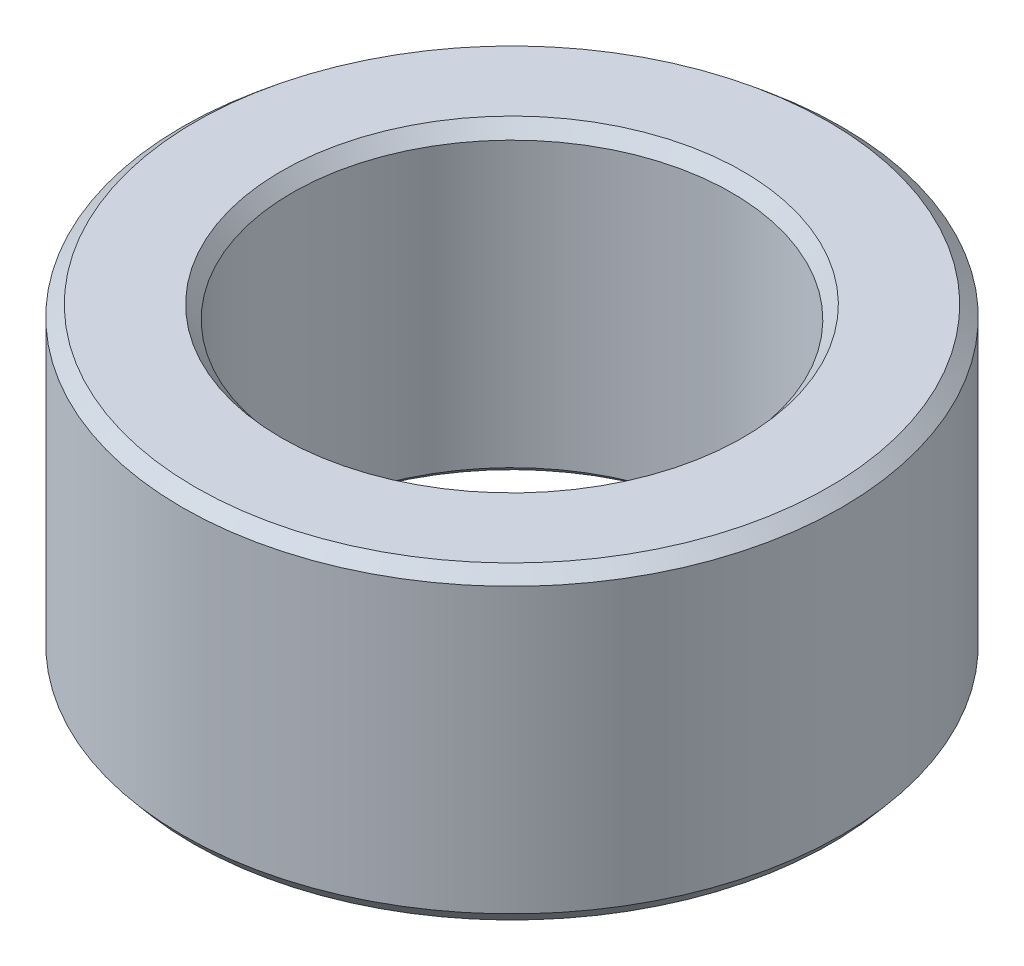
from build123d import *
from OCP.BRepFilletAPI import BRepFilletAPI_MakeChamfer

# Parameters (mm, degrees)
SKETCH1_R           = 15
SKETCH1_R_2         = 10
BOSS_EXTRUDE1_DEPTH = 7
CHAMFER1_SIZE       = 0.5
CHAMFER1_SIZE2      = 0.595876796


with BuildPart() as part:
    # Sketch1 → Boss-Extrude1 (new, symmetric)
    with BuildSketch(Plane(origin=(0, 0, 0), x_dir=(1, 0, 0), z_dir=(0, 1, 0))):
        with Locations(Location((0, 0, 0), (0, 0, 270))):
            Circle(SKETCH1_R)
        with Locations(Location((0, 0, 0), (0, 0, 270))):
            Circle(SKETCH1_R_2, mode=Mode.SUBTRACT)
    extrude(amount=BOSS_EXTRUDE1_DEPTH, both=True)

    # Chamfer1: one chamfer whose edges measure the first distance from different faces: ONE call of the kernel's chamfer builder (chamfer() names one face for all edges)
    chamfer1_edges_1 = [part.edges().sort_by_distance(p)[0] for p in [
        (0, -7, -15),
    ]]
    chamfer1_side_1 = [part.faces().sort_by_distance(p)[0] for p in [
        (0, -7, -14.575735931),
    ]]
    chamfer1_edges_2 = [part.edges().sort_by_distance(p)[0] for p in [
        (0, 7, -15),
    ]]
    chamfer1_side_2 = [part.faces().sort_by_distance(p)[0] for p in [
        (0, 0, -15),
    ]]
    chamfer1_edges_3 = [part.edges().sort_by_distance(p)[0] for p in [
        (0, -7, -10),
    ]]
    chamfer1_side_3 = [part.faces().sort_by_distance(p)[0] for p in [
        (0, 0, -10),
    ]]
    chamfer1_edges_4 = [part.edges().sort_by_distance(p)[0] for p in [
        (0, 7, -10),
    ]]
    chamfer1_side_4 = [part.faces().sort_by_distance(p)[0] for p in [
        (0, 7, -14.575735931),
    ]]
    chamfer1 = BRepFilletAPI_MakeChamfer(part.part.solid().wrapped)
    for e in chamfer1_edges_1:
        chamfer1.Add(CHAMFER1_SIZE, CHAMFER1_SIZE2, e.wrapped, chamfer1_side_1[0].wrapped)  # the first distance lies on this face
    for e in chamfer1_edges_2:
        chamfer1.Add(CHAMFER1_SIZE, CHAMFER1_SIZE2, e.wrapped, chamfer1_side_2[0].wrapped)  # the first distance lies on this face
    for e in chamfer1_edges_3:
        chamfer1.Add(CHAMFER1_SIZE, CHAMFER1_SIZE2, e.wrapped, chamfer1_side_3[0].wrapped)  # the first distance lies on this face
    for e in chamfer1_edges_4:
        chamfer1.Add(CHAMFER1_SIZE, CHAMFER1_SIZE2, e.wrapped, chamfer1_side_4[0].wrapped)  # the first distance lies on this face
    add(Compound.cast(chamfer1.Shape()), mode=Mode.REPLACE)


solid = part.part
